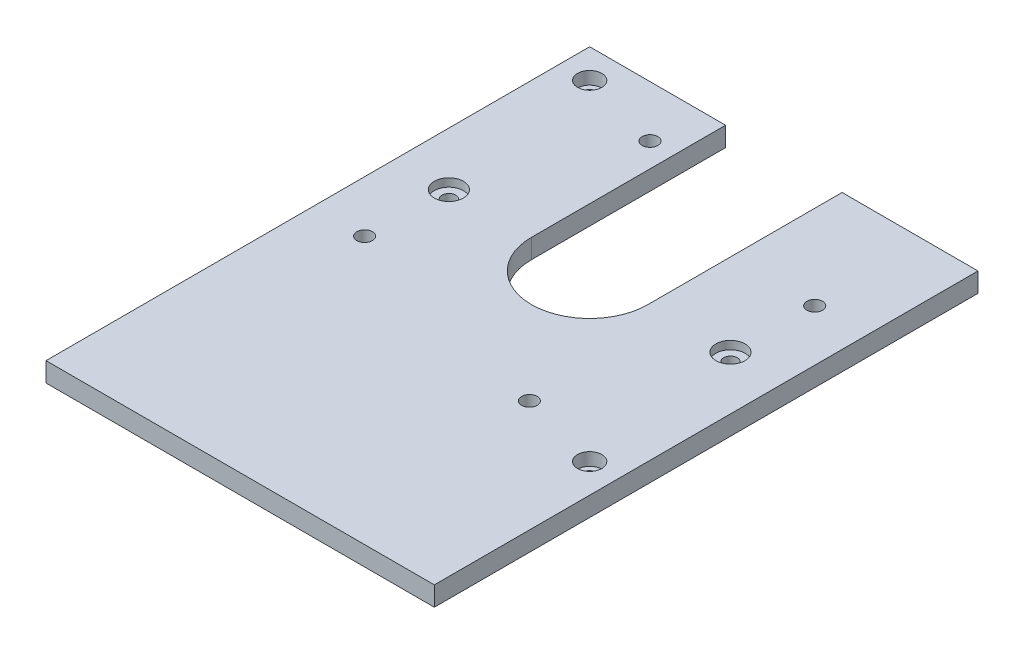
ISO-10303-21;
HEADER;
FILE_DESCRIPTION(('STEP AP214'),'2;1');
FILE_NAME('part.step','',(''),(''),'','','');
FILE_SCHEMA(('AUTOMOTIVE_DESIGN { 1 0 10303 214 1 1 1 1 }'));
ENDSEC;
DATA;
#1=APPLICATION_CONTEXT('core data for automotive mechanical design processes');
#2=APPLICATION_PROTOCOL_DEFINITION('international standard','automotive_design',2000,#1);
#3=PRODUCT_CONTEXT('',#1,'mechanical');
#4=PRODUCT('Part','Part','',(#3));
#5=PRODUCT_RELATED_PRODUCT_CATEGORY('part','',(#4));
#6=PRODUCT_DEFINITION_FORMATION('','',#4);
#7=PRODUCT_DEFINITION_CONTEXT('part definition',#1,'design');
#8=PRODUCT_DEFINITION('design','',#6,#7);
#9=PRODUCT_DEFINITION_SHAPE('','',#8);
#10=(LENGTH_UNIT() NAMED_UNIT(*) SI_UNIT(.MILLI.,.METRE.));
#11=(NAMED_UNIT(*) PLANE_ANGLE_UNIT() SI_UNIT($,.RADIAN.));
#12=(NAMED_UNIT(*) SI_UNIT($,.STERADIAN.) SOLID_ANGLE_UNIT());
#13=UNCERTAINTY_MEASURE_WITH_UNIT(LENGTH_MEASURE(1.E-05),#10,'distance_accuracy_value','');
#14=(GEOMETRIC_REPRESENTATION_CONTEXT(3) GLOBAL_UNCERTAINTY_ASSIGNED_CONTEXT((#13)) GLOBAL_UNIT_ASSIGNED_CONTEXT((#10,
#11,#12)) REPRESENTATION_CONTEXT('',''));
#15=CARTESIAN_POINT('',(0.,0.,0.));
#16=DIRECTION('',(0.,0.,1.));
#17=DIRECTION('',(1.,0.,0.));
#18=AXIS2_PLACEMENT_3D('',#15,#16,#17);
#19=CARTESIAN_POINT('',(-63.5,6.35,-63.5));
#20=DIRECTION('',(0.,0.,1.));
#21=DIRECTION('',(1.,0.,0.));
#22=AXIS2_PLACEMENT_3D('',#19,#20,#21);
#23=PLANE('',#22);
#24=DIRECTION('',(0.,1.,0.));
#25=VECTOR('',#24,1.);
#26=CARTESIAN_POINT('',(-19.05,0.,-63.5));
#27=LINE('',#26,#25);
#28=CARTESIAN_POINT('',(-19.05,0.,-63.5));
#29=VERTEX_POINT('',#28);
#30=CARTESIAN_POINT('',(-19.05,6.35,-63.5));
#31=VERTEX_POINT('',#30);
#32=EDGE_CURVE('E92',#29,#31,#27,.T.);
#33=ORIENTED_EDGE('',*,*,#32,.F.);
#34=DIRECTION('',(-1.,0.,0.));
#35=VECTOR('',#34,1.);
#36=CARTESIAN_POINT('',(-63.5,0.,-63.5));
#37=LINE('',#36,#35);
#38=CARTESIAN_POINT('',(-63.5,0.,-63.5));
#39=VERTEX_POINT('',#38);
#40=EDGE_CURVE('E88',#29,#39,#37,.T.);
#41=ORIENTED_EDGE('',*,*,#40,.T.);
#42=DIRECTION('',(0.,-1.,0.));
#43=VECTOR('',#42,1.);
#44=CARTESIAN_POINT('',(-63.5,6.35,-63.5));
#45=LINE('',#44,#43);
#46=CARTESIAN_POINT('',(-63.5,6.35,-63.5));
#47=VERTEX_POINT('',#46);
#48=EDGE_CURVE('E57',#47,#39,#45,.T.);
#49=ORIENTED_EDGE('',*,*,#48,.F.);
#50=DIRECTION('',(-1.,0.,0.));
#51=VECTOR('',#50,1.);
#52=CARTESIAN_POINT('',(-63.5,6.35,-63.5));
#53=LINE('',#52,#51);
#54=EDGE_CURVE('E74',#31,#47,#53,.T.);
#55=ORIENTED_EDGE('',*,*,#54,.F.);
#56=EDGE_LOOP('',(#33,#41,#49,#55));
#57=FACE_BOUND('',#56,.T.);
#58=ADVANCED_FACE('F47',(#57),#23,.F.);
#59=DIRECTION('',(0.,1.,0.));
#60=VECTOR('',#59,1.);
#61=CARTESIAN_POINT('',(19.05,0.,-63.5));
#62=LINE('',#61,#60);
#63=CARTESIAN_POINT('',(19.05,0.,-63.5));
#64=VERTEX_POINT('',#63);
#65=CARTESIAN_POINT('',(19.05,6.35,-63.5));
#66=VERTEX_POINT('',#65);
#67=EDGE_CURVE('E267',#64,#66,#62,.T.);
#68=ORIENTED_EDGE('',*,*,#67,.T.);
#69=CARTESIAN_POINT('',(63.5,6.35,-63.5));
#70=VERTEX_POINT('',#69);
#71=EDGE_CURVE('E215',#70,#66,#53,.T.);
#72=ORIENTED_EDGE('',*,*,#71,.F.);
#73=DIRECTION('',(0.,-1.,0.));
#74=VECTOR('',#73,1.);
#75=CARTESIAN_POINT('',(63.5,6.35,-63.5));
#76=LINE('',#75,#74);
#77=CARTESIAN_POINT('',(63.5,0.,-63.5));
#78=VERTEX_POINT('',#77);
#79=EDGE_CURVE('E11',#70,#78,#76,.T.);
#80=ORIENTED_EDGE('',*,*,#79,.T.);
#81=EDGE_CURVE('E97',#78,#64,#37,.T.);
#82=ORIENTED_EDGE('',*,*,#81,.T.);
#83=EDGE_LOOP('',(#68,#72,#80,#82));
#84=FACE_BOUND('',#83,.T.);
#85=ADVANCED_FACE('F291',(#84),#23,.F.);
#86=CARTESIAN_POINT('',(0.,6.35,0.));
#87=DIRECTION('',(0.,-1.,0.));
#88=DIRECTION('',(0.,0.,-1.));
#89=AXIS2_PLACEMENT_3D('',#86,#87,#88);
#90=PLANE('',#89);
#91=CARTESIAN_POINT('',(46.0502,6.35,0.));
#92=DIRECTION('',(0.,1.,0.));
#93=DIRECTION('',(0.,0.,1.));
#94=AXIS2_PLACEMENT_3D('',#91,#92,#93);
#95=CIRCLE('',#94,4.7625);
#96=CARTESIAN_POINT('',(46.0502,6.35,4.7625));
#97=VERTEX_POINT('',#96);
#98=EDGE_CURVE('E136',#97,#97,#95,.T.);
#99=ORIENTED_EDGE('',*,*,#98,.F.);
#100=EDGE_LOOP('',(#99));
#101=FACE_BOUND('',#100,.T.);
#102=CARTESIAN_POINT('',(-46.0502,6.35,0.));
#103=DIRECTION('',(0.,1.,0.));
#104=DIRECTION('',(0.,0.,1.));
#105=AXIS2_PLACEMENT_3D('',#102,#103,#104);
#106=CIRCLE('',#105,4.7625);
#107=CARTESIAN_POINT('',(-46.0502,6.35,4.7625));
#108=VERTEX_POINT('',#107);
#109=EDGE_CURVE('E142',#108,#108,#106,.T.);
#110=ORIENTED_EDGE('',*,*,#109,.F.);
#111=EDGE_LOOP('',(#110));
#112=FACE_BOUND('',#111,.T.);
#113=CARTESIAN_POINT('',(53.975,6.35,53.975));
#114=DIRECTION('',(0.,1.,0.));
#115=DIRECTION('',(0.,0.,1.));
#116=AXIS2_PLACEMENT_3D('',#113,#114,#115);
#117=CIRCLE('',#116,3.96875);
#118=CARTESIAN_POINT('',(53.975,6.35,57.94375));
#119=VERTEX_POINT('',#118);
#120=EDGE_CURVE('E148',#119,#119,#117,.T.);
#121=ORIENTED_EDGE('',*,*,#120,.F.);
#122=EDGE_LOOP('',(#121));
#123=FACE_BOUND('',#122,.T.);
#124=CARTESIAN_POINT('',(-53.975,6.35,-53.975));
#125=DIRECTION('',(0.,1.,0.));
#126=DIRECTION('',(0.,0.,1.));
#127=AXIS2_PLACEMENT_3D('',#124,#125,#126);
#128=CIRCLE('',#127,3.96875);
#129=CARTESIAN_POINT('',(-53.975,6.35,-50.00625));
#130=VERTEX_POINT('',#129);
#131=EDGE_CURVE('E153',#130,#130,#128,.T.);
#132=ORIENTED_EDGE('',*,*,#131,.F.);
#133=EDGE_LOOP('',(#132));
#134=FACE_BOUND('',#133,.T.);
#135=CARTESIAN_POINT('',(-26.9405100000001,6.35,-46.6623321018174));
#136=DIRECTION('',(0.,1.,0.));
#137=DIRECTION('',(0.,0.,1.));
#138=AXIS2_PLACEMENT_3D('',#135,#136,#137);
#139=CIRCLE('',#138,2.5527);
#140=CARTESIAN_POINT('',(-26.9405100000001,6.35,-44.1096321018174));
#141=VERTEX_POINT('',#140);
#142=EDGE_CURVE('E154',#141,#141,#139,.T.);
#143=ORIENTED_EDGE('',*,*,#142,.F.);
#144=EDGE_LOOP('',(#143));
#145=FACE_BOUND('',#144,.T.);
#146=CARTESIAN_POINT('',(46.6623319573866,6.35,-26.9405099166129));
#147=DIRECTION('',(0.,1.,0.));
#148=DIRECTION('',(0.,0.,1.));
#149=AXIS2_PLACEMENT_3D('',#146,#147,#148);
#150=CIRCLE('',#149,2.5527);
#151=CARTESIAN_POINT('',(46.6623319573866,6.35,-24.3878099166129));
#152=VERTEX_POINT('',#151);
#153=EDGE_CURVE('E158',#152,#152,#150,.T.);
#154=ORIENTED_EDGE('',*,*,#153,.F.);
#155=EDGE_LOOP('',(#154));
#156=FACE_BOUND('',#155,.T.);
#157=CARTESIAN_POINT('',(26.94000618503,6.35,46.6614594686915));
#158=DIRECTION('',(0.,1.,0.));
#159=DIRECTION('',(0.,0.,1.));
#160=AXIS2_PLACEMENT_3D('',#157,#158,#159);
#161=CIRCLE('',#160,2.5527);
#162=CARTESIAN_POINT('',(26.94000618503,6.35,49.2141594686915));
#163=VERTEX_POINT('',#162);
#164=EDGE_CURVE('E172',#163,#163,#161,.T.);
#165=ORIENTED_EDGE('',*,*,#164,.F.);
#166=EDGE_LOOP('',(#165));
#167=FACE_BOUND('',#166,.T.);
#168=CARTESIAN_POINT('',(-46.6599047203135,6.35,26.9391085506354));
#169=DIRECTION('',(0.,1.,0.));
#170=DIRECTION('',(0.,0.,1.));
#171=AXIS2_PLACEMENT_3D('',#168,#169,#170);
#172=CIRCLE('',#171,2.5527);
#173=CARTESIAN_POINT('',(-46.6599047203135,6.35,29.4918085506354));
#174=VERTEX_POINT('',#173);
#175=EDGE_CURVE('E266',#174,#174,#172,.T.);
#176=ORIENTED_EDGE('',*,*,#175,.F.);
#177=EDGE_LOOP('',(#176));
#178=FACE_BOUND('',#177,.T.);
#179=DIRECTION('',(0.,0.,-1.));
#180=VECTOR('',#179,1.);
#181=CARTESIAN_POINT('',(-19.05,6.35,0.));
#182=LINE('',#181,#180);
#183=CARTESIAN_POINT('',(-19.05,6.35,0.));
#184=VERTEX_POINT('',#183);
#185=EDGE_CURVE('E243',#184,#31,#182,.T.);
#186=ORIENTED_EDGE('',*,*,#185,.T.);
#187=ORIENTED_EDGE('',*,*,#54,.T.);
#188=DIRECTION('',(0.,0.,1.));
#189=VECTOR('',#188,1.);
#190=CARTESIAN_POINT('',(-63.5,6.35,63.5));
#191=LINE('',#190,#189);
#192=CARTESIAN_POINT('',(-63.5,6.35,114.3));
#193=VERTEX_POINT('',#192);
#194=EDGE_CURVE('E107',#47,#193,#191,.T.);
#195=ORIENTED_EDGE('',*,*,#194,.T.);
#196=DIRECTION('',(-1.,0.,0.));
#197=VECTOR('',#196,1.);
#198=CARTESIAN_POINT('',(-63.5,6.35,114.3));
#199=LINE('',#198,#197);
#200=CARTESIAN_POINT('',(63.5,6.35,114.3));
#201=VERTEX_POINT('',#200);
#202=EDGE_CURVE('E238',#201,#193,#199,.T.);
#203=ORIENTED_EDGE('',*,*,#202,.F.);
#204=DIRECTION('',(0.,0.,-1.));
#205=VECTOR('',#204,1.);
#206=CARTESIAN_POINT('',(63.5,6.35,63.5));
#207=LINE('',#206,#205);
#208=EDGE_CURVE('E116',#201,#70,#207,.T.);
#209=ORIENTED_EDGE('',*,*,#208,.T.);
#210=ORIENTED_EDGE('',*,*,#71,.T.);
#211=DIRECTION('',(0.,0.,1.));
#212=VECTOR('',#211,1.);
#213=CARTESIAN_POINT('',(19.05,6.35,0.));
#214=LINE('',#213,#212);
#215=CARTESIAN_POINT('',(19.05,6.35,0.));
#216=VERTEX_POINT('',#215);
#217=EDGE_CURVE('E249',#66,#216,#214,.T.);
#218=ORIENTED_EDGE('',*,*,#217,.T.);
#219=CARTESIAN_POINT('',(0.,6.35,0.));
#220=DIRECTION('',(0.,1.,0.));
#221=DIRECTION('',(0.,0.,1.));
#222=AXIS2_PLACEMENT_3D('',#219,#220,#221);
#223=CIRCLE('',#222,19.05);
#224=EDGE_CURVE('E258',#184,#216,#223,.T.);
#225=ORIENTED_EDGE('',*,*,#224,.F.);
#226=EDGE_LOOP('',(#186,#187,#195,#203,#209,#210,#218,#225));
#227=FACE_BOUND('',#226,.T.);
#228=ADVANCED_FACE('F288',(#101,#112,#123,#134,#145,#156,#167,#178,#227),#90,.F.);
#229=CARTESIAN_POINT('',(0.,0.,0.));
#230=DIRECTION('',(0.,-1.,0.));
#231=DIRECTION('',(0.,0.,-1.));
#232=AXIS2_PLACEMENT_3D('',#229,#230,#231);
#233=PLANE('',#232);
#234=CARTESIAN_POINT('',(-46.6599047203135,0.,26.9391085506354));
#235=DIRECTION('',(0.,-1.,0.));
#236=DIRECTION('',(0.,0.,-1.));
#237=AXIS2_PLACEMENT_3D('',#234,#235,#236);
#238=CIRCLE('',#237,2.5527);
#239=CARTESIAN_POINT('',(-46.6599047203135,0.,24.3864085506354));
#240=VERTEX_POINT('',#239);
#241=EDGE_CURVE('E278',#240,#240,#238,.T.);
#242=ORIENTED_EDGE('',*,*,#241,.F.);
#243=EDGE_LOOP('',(#242));
#244=FACE_BOUND('',#243,.T.);
#245=CARTESIAN_POINT('',(26.94000618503,0.,46.6614594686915));
#246=DIRECTION('',(0.,-1.,0.));
#247=DIRECTION('',(0.,0.,-1.));
#248=AXIS2_PLACEMENT_3D('',#245,#246,#247);
#249=CIRCLE('',#248,2.5527);
#250=CARTESIAN_POINT('',(26.94000618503,0.,44.1087594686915));
#251=VERTEX_POINT('',#250);
#252=EDGE_CURVE('E51',#251,#251,#249,.T.);
#253=ORIENTED_EDGE('',*,*,#252,.F.);
#254=EDGE_LOOP('',(#253));
#255=FACE_BOUND('',#254,.T.);
#256=CARTESIAN_POINT('',(46.6623319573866,0.,-26.9405099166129));
#257=DIRECTION('',(0.,-1.,0.));
#258=DIRECTION('',(0.,0.,-1.));
#259=AXIS2_PLACEMENT_3D('',#256,#257,#258);
#260=CIRCLE('',#259,2.5527);
#261=CARTESIAN_POINT('',(46.6623319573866,0.,-29.4932099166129));
#262=VERTEX_POINT('',#261);
#263=EDGE_CURVE('E155',#262,#262,#260,.T.);
#264=ORIENTED_EDGE('',*,*,#263,.F.);
#265=EDGE_LOOP('',(#264));
#266=FACE_BOUND('',#265,.T.);
#267=CARTESIAN_POINT('',(-26.9405100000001,0.,-46.6623321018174));
#268=DIRECTION('',(0.,-1.,0.));
#269=DIRECTION('',(0.,0.,-1.));
#270=AXIS2_PLACEMENT_3D('',#267,#268,#269);
#271=CIRCLE('',#270,2.5527);
#272=CARTESIAN_POINT('',(-26.9405100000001,0.,-49.2150321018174));
#273=VERTEX_POINT('',#272);
#274=EDGE_CURVE('E150',#273,#273,#271,.T.);
#275=ORIENTED_EDGE('',*,*,#274,.F.);
#276=EDGE_LOOP('',(#275));
#277=FACE_BOUND('',#276,.T.);
#278=CARTESIAN_POINT('',(-53.975,0.,-53.975));
#279=DIRECTION('',(0.,-1.,0.));
#280=DIRECTION('',(0.,0.,-1.));
#281=AXIS2_PLACEMENT_3D('',#278,#279,#280);
#282=CIRCLE('',#281,2.2479);
#283=CARTESIAN_POINT('',(-53.975,0.,-56.2229));
#284=VERTEX_POINT('',#283);
#285=EDGE_CURVE('E144',#284,#284,#282,.T.);
#286=ORIENTED_EDGE('',*,*,#285,.F.);
#287=EDGE_LOOP('',(#286));
#288=FACE_BOUND('',#287,.T.);
#289=CARTESIAN_POINT('',(53.975,0.,53.975));
#290=DIRECTION('',(0.,-1.,0.));
#291=DIRECTION('',(0.,0.,-1.));
#292=AXIS2_PLACEMENT_3D('',#289,#290,#291);
#293=CIRCLE('',#292,2.2479);
#294=CARTESIAN_POINT('',(53.975,0.,51.7271));
#295=VERTEX_POINT('',#294);
#296=EDGE_CURVE('E138',#295,#295,#293,.T.);
#297=ORIENTED_EDGE('',*,*,#296,.F.);
#298=EDGE_LOOP('',(#297));
#299=FACE_BOUND('',#298,.T.);
#300=CARTESIAN_POINT('',(-46.0502,0.,0.));
#301=DIRECTION('',(0.,-1.,0.));
#302=DIRECTION('',(0.,0.,-1.));
#303=AXIS2_PLACEMENT_3D('',#300,#301,#302);
#304=CIRCLE('',#303,2.2479);
#305=CARTESIAN_POINT('',(-46.0502,0.,-2.2479));
#306=VERTEX_POINT('',#305);
#307=EDGE_CURVE('E132',#306,#306,#304,.T.);
#308=ORIENTED_EDGE('',*,*,#307,.F.);
#309=EDGE_LOOP('',(#308));
#310=FACE_BOUND('',#309,.T.);
#311=CARTESIAN_POINT('',(46.0502,0.,0.));
#312=DIRECTION('',(0.,-1.,0.));
#313=DIRECTION('',(0.,0.,-1.));
#314=AXIS2_PLACEMENT_3D('',#311,#312,#313);
#315=CIRCLE('',#314,2.2479);
#316=CARTESIAN_POINT('',(46.0502,0.,-2.2479));
#317=VERTEX_POINT('',#316);
#318=EDGE_CURVE('E127',#317,#317,#315,.T.);
#319=ORIENTED_EDGE('',*,*,#318,.F.);
#320=EDGE_LOOP('',(#319));
#321=FACE_BOUND('',#320,.T.);
#322=ORIENTED_EDGE('',*,*,#40,.F.);
#323=DIRECTION('',(0.,0.,-1.));
#324=VECTOR('',#323,1.);
#325=CARTESIAN_POINT('',(-19.05,0.,0.));
#326=LINE('',#325,#324);
#327=CARTESIAN_POINT('',(-19.05,0.,0.));
#328=VERTEX_POINT('',#327);
#329=EDGE_CURVE('E244',#328,#29,#326,.T.);
#330=ORIENTED_EDGE('',*,*,#329,.F.);
#331=CARTESIAN_POINT('',(0.,0.,0.));
#332=DIRECTION('',(0.,1.,0.));
#333=DIRECTION('',(0.,0.,1.));
#334=AXIS2_PLACEMENT_3D('',#331,#332,#333);
#335=CIRCLE('',#334,19.05);
#336=CARTESIAN_POINT('',(19.05,0.,0.));
#337=VERTEX_POINT('',#336);
#338=EDGE_CURVE('E248',#328,#337,#335,.T.);
#339=ORIENTED_EDGE('',*,*,#338,.T.);
#340=DIRECTION('',(0.,0.,1.));
#341=VECTOR('',#340,1.);
#342=CARTESIAN_POINT('',(19.05,0.,0.));
#343=LINE('',#342,#341);
#344=EDGE_CURVE('E252',#64,#337,#343,.T.);
#345=ORIENTED_EDGE('',*,*,#344,.F.);
#346=ORIENTED_EDGE('',*,*,#81,.F.);
#347=DIRECTION('',(0.,0.,-1.));
#348=VECTOR('',#347,1.);
#349=CARTESIAN_POINT('',(63.5,0.,63.5));
#350=LINE('',#349,#348);
#351=CARTESIAN_POINT('',(63.5,0.,114.3));
#352=VERTEX_POINT('',#351);
#353=EDGE_CURVE('E98',#352,#78,#350,.T.);
#354=ORIENTED_EDGE('',*,*,#353,.F.);
#355=DIRECTION('',(1.,0.,0.));
#356=VECTOR('',#355,1.);
#357=CARTESIAN_POINT('',(-63.5,0.,114.3));
#358=LINE('',#357,#356);
#359=CARTESIAN_POINT('',(-63.5,0.,114.3));
#360=VERTEX_POINT('',#359);
#361=EDGE_CURVE('E113',#360,#352,#358,.T.);
#362=ORIENTED_EDGE('',*,*,#361,.F.);
#363=DIRECTION('',(0.,0.,1.));
#364=VECTOR('',#363,1.);
#365=CARTESIAN_POINT('',(-63.5,0.,63.5));
#366=LINE('',#365,#364);
#367=EDGE_CURVE('E105',#39,#360,#366,.T.);
#368=ORIENTED_EDGE('',*,*,#367,.F.);
#369=EDGE_LOOP('',(#322,#330,#339,#345,#346,#354,#362,#368));
#370=FACE_BOUND('',#369,.T.);
#371=ADVANCED_FACE('F110',(#244,#255,#266,#277,#288,#299,#310,#321,#370),#233,.T.);
#372=CARTESIAN_POINT('',(63.5,6.35,63.5));
#373=DIRECTION('',(-1.,0.,0.));
#374=DIRECTION('',(0.,0.,1.));
#375=AXIS2_PLACEMENT_3D('',#372,#373,#374);
#376=PLANE('',#375);
#377=ORIENTED_EDGE('',*,*,#353,.T.);
#378=ORIENTED_EDGE('',*,*,#79,.F.);
#379=ORIENTED_EDGE('',*,*,#208,.F.);
#380=DIRECTION('',(0.,1.,0.));
#381=VECTOR('',#380,1.);
#382=CARTESIAN_POINT('',(63.5,6.35,114.3));
#383=LINE('',#382,#381);
#384=EDGE_CURVE('E228',#352,#201,#383,.T.);
#385=ORIENTED_EDGE('',*,*,#384,.F.);
#386=EDGE_LOOP('',(#377,#378,#379,#385));
#387=FACE_BOUND('',#386,.T.);
#388=ADVANCED_FACE('F49',(#387),#376,.F.);
#389=CARTESIAN_POINT('',(-63.5,6.35,63.5));
#390=DIRECTION('',(1.,0.,0.));
#391=DIRECTION('',(0.,0.,-1.));
#392=AXIS2_PLACEMENT_3D('',#389,#390,#391);
#393=PLANE('',#392);
#394=ORIENTED_EDGE('',*,*,#367,.T.);
#395=DIRECTION('',(0.,-1.,0.));
#396=VECTOR('',#395,1.);
#397=CARTESIAN_POINT('',(-63.5,6.35,114.3));
#398=LINE('',#397,#396);
#399=EDGE_CURVE('E236',#193,#360,#398,.T.);
#400=ORIENTED_EDGE('',*,*,#399,.F.);
#401=ORIENTED_EDGE('',*,*,#194,.F.);
#402=ORIENTED_EDGE('',*,*,#48,.T.);
#403=EDGE_LOOP('',(#394,#400,#401,#402));
#404=FACE_BOUND('',#403,.T.);
#405=ADVANCED_FACE('F102',(#404),#393,.F.);
#406=CARTESIAN_POINT('',(46.0502,6.35,0.));
#407=DIRECTION('',(0.,1.,0.));
#408=DIRECTION('',(0.,0.,1.));
#409=AXIS2_PLACEMENT_3D('',#406,#407,#408);
#410=CYLINDRICAL_SURFACE('',#409,2.2479);
#411=ORIENTED_EDGE('',*,*,#318,.T.);
#412=EDGE_LOOP('',(#411));
#413=FACE_BOUND('',#412,.T.);
#414=CARTESIAN_POINT('',(46.0502,3.683,0.));
#415=DIRECTION('',(0.,1.,0.));
#416=DIRECTION('',(0.,0.,1.));
#417=AXIS2_PLACEMENT_3D('',#414,#415,#416);
#418=CIRCLE('',#417,2.2479);
#419=CARTESIAN_POINT('',(46.0502,3.683,2.2479));
#420=VERTEX_POINT('',#419);
#421=EDGE_CURVE('E131',#420,#420,#418,.T.);
#422=ORIENTED_EDGE('',*,*,#421,.T.);
#423=EDGE_LOOP('',(#422));
#424=FACE_BOUND('',#423,.T.);
#425=ADVANCED_FACE('F339',(#413,#424),#410,.F.);
#426=CARTESIAN_POINT('',(48.2981,3.683,0.));
#427=DIRECTION('',(0.,-1.,0.));
#428=DIRECTION('',(0.,0.,-1.));
#429=AXIS2_PLACEMENT_3D('',#426,#427,#428);
#430=PLANE('',#429);
#431=ORIENTED_EDGE('',*,*,#421,.F.);
#432=EDGE_LOOP('',(#431));
#433=FACE_BOUND('',#432,.T.);
#434=CARTESIAN_POINT('',(46.0502,3.683,0.));
#435=DIRECTION('',(0.,1.,0.));
#436=DIRECTION('',(0.,0.,1.));
#437=AXIS2_PLACEMENT_3D('',#434,#435,#436);
#438=CIRCLE('',#437,4.7625);
#439=CARTESIAN_POINT('',(46.0502,3.683,4.7625));
#440=VERTEX_POINT('',#439);
#441=EDGE_CURVE('E208',#440,#440,#438,.T.);
#442=ORIENTED_EDGE('',*,*,#441,.T.);
#443=EDGE_LOOP('',(#442));
#444=FACE_BOUND('',#443,.T.);
#445=ADVANCED_FACE('F345',(#433,#444),#430,.F.);
#446=CARTESIAN_POINT('',(46.0502,6.35,0.));
#447=DIRECTION('',(0.,1.,0.));
#448=DIRECTION('',(0.,0.,1.));
#449=AXIS2_PLACEMENT_3D('',#446,#447,#448);
#450=CYLINDRICAL_SURFACE('',#449,4.7625);
#451=ORIENTED_EDGE('',*,*,#441,.F.);
#452=EDGE_LOOP('',(#451));
#453=FACE_BOUND('',#452,.T.);
#454=ORIENTED_EDGE('',*,*,#98,.T.);
#455=EDGE_LOOP('',(#454));
#456=FACE_BOUND('',#455,.T.);
#457=ADVANCED_FACE('F349',(#453,#456),#450,.F.);
#458=CARTESIAN_POINT('',(-46.0502,6.35,0.));
#459=DIRECTION('',(0.,1.,0.));
#460=DIRECTION('',(0.,0.,1.));
#461=AXIS2_PLACEMENT_3D('',#458,#459,#460);
#462=CYLINDRICAL_SURFACE('',#461,2.2479);
#463=ORIENTED_EDGE('',*,*,#307,.T.);
#464=EDGE_LOOP('',(#463));
#465=FACE_BOUND('',#464,.T.);
#466=CARTESIAN_POINT('',(-46.0502,3.683,0.));
#467=DIRECTION('',(0.,1.,0.));
#468=DIRECTION('',(0.,0.,1.));
#469=AXIS2_PLACEMENT_3D('',#466,#467,#468);
#470=CIRCLE('',#469,2.2479);
#471=CARTESIAN_POINT('',(-46.0502,3.683,2.2479));
#472=VERTEX_POINT('',#471);
#473=EDGE_CURVE('E137',#472,#472,#470,.T.);
#474=ORIENTED_EDGE('',*,*,#473,.T.);
#475=EDGE_LOOP('',(#474));
#476=FACE_BOUND('',#475,.T.);
#477=ADVANCED_FACE('F353',(#465,#476),#462,.F.);
#478=CARTESIAN_POINT('',(-43.8023,3.683,0.));
#479=DIRECTION('',(0.,-1.,0.));
#480=DIRECTION('',(0.,0.,-1.));
#481=AXIS2_PLACEMENT_3D('',#478,#479,#480);
#482=PLANE('',#481);
#483=ORIENTED_EDGE('',*,*,#473,.F.);
#484=EDGE_LOOP('',(#483));
#485=FACE_BOUND('',#484,.T.);
#486=CARTESIAN_POINT('',(-46.0502,3.683,0.));
#487=DIRECTION('',(0.,1.,0.));
#488=DIRECTION('',(0.,0.,1.));
#489=AXIS2_PLACEMENT_3D('',#486,#487,#488);
#490=CIRCLE('',#489,4.7625);
#491=CARTESIAN_POINT('',(-46.0502,3.683,4.7625));
#492=VERTEX_POINT('',#491);
#493=EDGE_CURVE('E199',#492,#492,#490,.T.);
#494=ORIENTED_EDGE('',*,*,#493,.T.);
#495=EDGE_LOOP('',(#494));
#496=FACE_BOUND('',#495,.T.);
#497=ADVANCED_FACE('F357',(#485,#496),#482,.F.);
#498=CARTESIAN_POINT('',(-46.0502,6.35,0.));
#499=DIRECTION('',(0.,1.,0.));
#500=DIRECTION('',(0.,0.,1.));
#501=AXIS2_PLACEMENT_3D('',#498,#499,#500);
#502=CYLINDRICAL_SURFACE('',#501,4.7625);
#503=ORIENTED_EDGE('',*,*,#493,.F.);
#504=EDGE_LOOP('',(#503));
#505=FACE_BOUND('',#504,.T.);
#506=ORIENTED_EDGE('',*,*,#109,.T.);
#507=EDGE_LOOP('',(#506));
#508=FACE_BOUND('',#507,.T.);
#509=ADVANCED_FACE('F361',(#505,#508),#502,.F.);
#510=CARTESIAN_POINT('',(53.975,6.35,53.975));
#511=DIRECTION('',(0.,1.,0.));
#512=DIRECTION('',(0.,0.,1.));
#513=AXIS2_PLACEMENT_3D('',#510,#511,#512);
#514=CYLINDRICAL_SURFACE('',#513,2.2479);
#515=ORIENTED_EDGE('',*,*,#296,.T.);
#516=EDGE_LOOP('',(#515));
#517=FACE_BOUND('',#516,.T.);
#518=CARTESIAN_POINT('',(53.975,2.1844,53.975));
#519=DIRECTION('',(0.,1.,0.));
#520=DIRECTION('',(0.,0.,1.));
#521=AXIS2_PLACEMENT_3D('',#518,#519,#520);
#522=CIRCLE('',#521,2.2479);
#523=CARTESIAN_POINT('',(53.975,2.1844,56.2229));
#524=VERTEX_POINT('',#523);
#525=EDGE_CURVE('E143',#524,#524,#522,.T.);
#526=ORIENTED_EDGE('',*,*,#525,.T.);
#527=EDGE_LOOP('',(#526));
#528=FACE_BOUND('',#527,.T.);
#529=ADVANCED_FACE('F365',(#517,#528),#514,.F.);
#530=CARTESIAN_POINT('',(56.2229,2.1844,53.975));
#531=DIRECTION('',(0.,-1.,0.));
#532=DIRECTION('',(0.,0.,-1.));
#533=AXIS2_PLACEMENT_3D('',#530,#531,#532);
#534=PLANE('',#533);
#535=ORIENTED_EDGE('',*,*,#525,.F.);
#536=EDGE_LOOP('',(#535));
#537=FACE_BOUND('',#536,.T.);
#538=CARTESIAN_POINT('',(53.975,2.1844,53.975));
#539=DIRECTION('',(0.,1.,0.));
#540=DIRECTION('',(0.,0.,1.));
#541=AXIS2_PLACEMENT_3D('',#538,#539,#540);
#542=CIRCLE('',#541,3.96875);
#543=CARTESIAN_POINT('',(53.975,2.1844,57.94375));
#544=VERTEX_POINT('',#543);
#545=EDGE_CURVE('E189',#544,#544,#542,.T.);
#546=ORIENTED_EDGE('',*,*,#545,.T.);
#547=EDGE_LOOP('',(#546));
#548=FACE_BOUND('',#547,.T.);
#549=ADVANCED_FACE('F369',(#537,#548),#534,.F.);
#550=CARTESIAN_POINT('',(53.975,6.35,53.975));
#551=DIRECTION('',(0.,1.,0.));
#552=DIRECTION('',(0.,0.,1.));
#553=AXIS2_PLACEMENT_3D('',#550,#551,#552);
#554=CYLINDRICAL_SURFACE('',#553,3.96875);
#555=ORIENTED_EDGE('',*,*,#545,.F.);
#556=EDGE_LOOP('',(#555));
#557=FACE_BOUND('',#556,.T.);
#558=ORIENTED_EDGE('',*,*,#120,.T.);
#559=EDGE_LOOP('',(#558));
#560=FACE_BOUND('',#559,.T.);
#561=ADVANCED_FACE('F373',(#557,#560),#554,.F.);
#562=CARTESIAN_POINT('',(-53.975,6.35,-53.975));
#563=DIRECTION('',(0.,1.,0.));
#564=DIRECTION('',(0.,0.,1.));
#565=AXIS2_PLACEMENT_3D('',#562,#563,#564);
#566=CYLINDRICAL_SURFACE('',#565,2.2479);
#567=ORIENTED_EDGE('',*,*,#285,.T.);
#568=EDGE_LOOP('',(#567));
#569=FACE_BOUND('',#568,.T.);
#570=CARTESIAN_POINT('',(-53.975,2.1844,-53.975));
#571=DIRECTION('',(0.,1.,0.));
#572=DIRECTION('',(0.,0.,1.));
#573=AXIS2_PLACEMENT_3D('',#570,#571,#572);
#574=CIRCLE('',#573,2.2479);
#575=CARTESIAN_POINT('',(-53.975,2.1844,-51.7271));
#576=VERTEX_POINT('',#575);
#577=EDGE_CURVE('E149',#576,#576,#574,.T.);
#578=ORIENTED_EDGE('',*,*,#577,.T.);
#579=EDGE_LOOP('',(#578));
#580=FACE_BOUND('',#579,.T.);
#581=ADVANCED_FACE('F377',(#569,#580),#566,.F.);
#582=CARTESIAN_POINT('',(-51.7271,2.1844,-53.975));
#583=DIRECTION('',(0.,-1.,0.));
#584=DIRECTION('',(0.,0.,-1.));
#585=AXIS2_PLACEMENT_3D('',#582,#583,#584);
#586=PLANE('',#585);
#587=ORIENTED_EDGE('',*,*,#577,.F.);
#588=EDGE_LOOP('',(#587));
#589=FACE_BOUND('',#588,.T.);
#590=CARTESIAN_POINT('',(-53.975,2.1844,-53.975));
#591=DIRECTION('',(0.,1.,0.));
#592=DIRECTION('',(0.,0.,1.));
#593=AXIS2_PLACEMENT_3D('',#590,#591,#592);
#594=CIRCLE('',#593,3.96875);
#595=CARTESIAN_POINT('',(-53.975,2.1844,-50.00625));
#596=VERTEX_POINT('',#595);
#597=EDGE_CURVE('E179',#596,#596,#594,.T.);
#598=ORIENTED_EDGE('',*,*,#597,.T.);
#599=EDGE_LOOP('',(#598));
#600=FACE_BOUND('',#599,.T.);
#601=ADVANCED_FACE('F381',(#589,#600),#586,.F.);
#602=CARTESIAN_POINT('',(-53.975,6.35,-53.975));
#603=DIRECTION('',(0.,1.,0.));
#604=DIRECTION('',(0.,0.,1.));
#605=AXIS2_PLACEMENT_3D('',#602,#603,#604);
#606=CYLINDRICAL_SURFACE('',#605,3.96875);
#607=ORIENTED_EDGE('',*,*,#597,.F.);
#608=EDGE_LOOP('',(#607));
#609=FACE_BOUND('',#608,.T.);
#610=ORIENTED_EDGE('',*,*,#131,.T.);
#611=EDGE_LOOP('',(#610));
#612=FACE_BOUND('',#611,.T.);
#613=ADVANCED_FACE('F385',(#609,#612),#606,.F.);
#614=CARTESIAN_POINT('',(-26.9405100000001,6.35,-46.6623321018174));
#615=DIRECTION('',(0.,1.,0.));
#616=DIRECTION('',(0.,0.,1.));
#617=AXIS2_PLACEMENT_3D('',#614,#615,#616);
#618=CYLINDRICAL_SURFACE('',#617,2.5527);
#619=ORIENTED_EDGE('',*,*,#274,.T.);
#620=EDGE_LOOP('',(#619));
#621=FACE_BOUND('',#620,.T.);
#622=ORIENTED_EDGE('',*,*,#142,.T.);
#623=EDGE_LOOP('',(#622));
#624=FACE_BOUND('',#623,.T.);
#625=ADVANCED_FACE('F389',(#621,#624),#618,.F.);
#626=CARTESIAN_POINT('',(46.6623319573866,6.35,-26.9405099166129));
#627=DIRECTION('',(0.,1.,0.));
#628=DIRECTION('',(0.,0.,1.));
#629=AXIS2_PLACEMENT_3D('',#626,#627,#628);
#630=CYLINDRICAL_SURFACE('',#629,2.5527);
#631=ORIENTED_EDGE('',*,*,#263,.T.);
#632=EDGE_LOOP('',(#631));
#633=FACE_BOUND('',#632,.T.);
#634=ORIENTED_EDGE('',*,*,#153,.T.);
#635=EDGE_LOOP('',(#634));
#636=FACE_BOUND('',#635,.T.);
#637=ADVANCED_FACE('F393',(#633,#636),#630,.F.);
#638=CARTESIAN_POINT('',(26.94000618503,6.35,46.6614594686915));
#639=DIRECTION('',(0.,1.,0.));
#640=DIRECTION('',(0.,0.,1.));
#641=AXIS2_PLACEMENT_3D('',#638,#639,#640);
#642=CYLINDRICAL_SURFACE('',#641,2.5527);
#643=ORIENTED_EDGE('',*,*,#252,.T.);
#644=EDGE_LOOP('',(#643));
#645=FACE_BOUND('',#644,.T.);
#646=ORIENTED_EDGE('',*,*,#164,.T.);
#647=EDGE_LOOP('',(#646));
#648=FACE_BOUND('',#647,.T.);
#649=ADVANCED_FACE('F286',(#645,#648),#642,.F.);
#650=CARTESIAN_POINT('',(-46.6599047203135,6.35,26.9391085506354));
#651=DIRECTION('',(0.,1.,0.));
#652=DIRECTION('',(0.,0.,1.));
#653=AXIS2_PLACEMENT_3D('',#650,#651,#652);
#654=CYLINDRICAL_SURFACE('',#653,2.5527);
#655=ORIENTED_EDGE('',*,*,#241,.T.);
#656=EDGE_LOOP('',(#655));
#657=FACE_BOUND('',#656,.T.);
#658=ORIENTED_EDGE('',*,*,#175,.T.);
#659=EDGE_LOOP('',(#658));
#660=FACE_BOUND('',#659,.T.);
#661=ADVANCED_FACE('F399',(#657,#660),#654,.F.);
#662=CARTESIAN_POINT('',(-19.05,0.,0.));
#663=DIRECTION('',(1.,0.,0.));
#664=DIRECTION('',(0.,0.,-1.));
#665=AXIS2_PLACEMENT_3D('',#662,#663,#664);
#666=PLANE('',#665);
#667=ORIENTED_EDGE('',*,*,#185,.F.);
#668=DIRECTION('',(0.,1.,0.));
#669=VECTOR('',#668,1.);
#670=CARTESIAN_POINT('',(-19.05,0.,0.));
#671=LINE('',#670,#669);
#672=EDGE_CURVE('E255',#328,#184,#671,.T.);
#673=ORIENTED_EDGE('',*,*,#672,.F.);
#674=ORIENTED_EDGE('',*,*,#329,.T.);
#675=ORIENTED_EDGE('',*,*,#32,.T.);
#676=EDGE_LOOP('',(#667,#673,#674,#675));
#677=FACE_BOUND('',#676,.T.);
#678=ADVANCED_FACE('F304',(#677),#666,.T.);
#679=CARTESIAN_POINT('',(19.05,0.,0.));
#680=DIRECTION('',(-1.,0.,0.));
#681=DIRECTION('',(0.,0.,1.));
#682=AXIS2_PLACEMENT_3D('',#679,#680,#681);
#683=PLANE('',#682);
#684=ORIENTED_EDGE('',*,*,#217,.F.);
#685=ORIENTED_EDGE('',*,*,#67,.F.);
#686=ORIENTED_EDGE('',*,*,#344,.T.);
#687=DIRECTION('',(0.,1.,0.));
#688=VECTOR('',#687,1.);
#689=CARTESIAN_POINT('',(19.05,0.,0.));
#690=LINE('',#689,#688);
#691=EDGE_CURVE('E65',#337,#216,#690,.T.);
#692=ORIENTED_EDGE('',*,*,#691,.T.);
#693=EDGE_LOOP('',(#684,#685,#686,#692));
#694=FACE_BOUND('',#693,.T.);
#695=ADVANCED_FACE('F316',(#694),#683,.T.);
#696=CARTESIAN_POINT('',(0.,0.,0.));
#697=DIRECTION('',(0.,1.,0.));
#698=DIRECTION('',(0.,0.,1.));
#699=AXIS2_PLACEMENT_3D('',#696,#697,#698);
#700=CYLINDRICAL_SURFACE('',#699,19.05);
#701=ORIENTED_EDGE('',*,*,#224,.T.);
#702=ORIENTED_EDGE('',*,*,#691,.F.);
#703=ORIENTED_EDGE('',*,*,#338,.F.);
#704=ORIENTED_EDGE('',*,*,#672,.T.);
#705=EDGE_LOOP('',(#701,#702,#703,#704));
#706=FACE_BOUND('',#705,.T.);
#707=ADVANCED_FACE('F322',(#706),#700,.F.);
#708=CARTESIAN_POINT('',(0.,0.,114.3));
#709=DIRECTION('',(0.,0.,1.));
#710=DIRECTION('',(1.,0.,0.));
#711=AXIS2_PLACEMENT_3D('',#708,#709,#710);
#712=PLANE('',#711);
#713=ORIENTED_EDGE('',*,*,#399,.T.);
#714=ORIENTED_EDGE('',*,*,#361,.T.);
#715=ORIENTED_EDGE('',*,*,#384,.T.);
#716=ORIENTED_EDGE('',*,*,#202,.T.);
#717=EDGE_LOOP('',(#713,#714,#715,#716));
#718=FACE_BOUND('',#717,.T.);
#719=ADVANCED_FACE('F233',(#718),#712,.T.);
#720=CLOSED_SHELL('',(#58,#85,#228,#371,#388,#405,#425,#445,#457,#477,#497,#509,#529,#549,#561,
#581,#601,#613,#625,#637,#649,#661,#678,#695,#707,#719));
#721=MANIFOLD_SOLID_BREP('B2',#720);
#722=ADVANCED_BREP_SHAPE_REPRESENTATION('',(#18,#721),#14);
#723=SHAPE_DEFINITION_REPRESENTATION(#9,#722);
ENDSEC;
END-ISO-10303-21;
